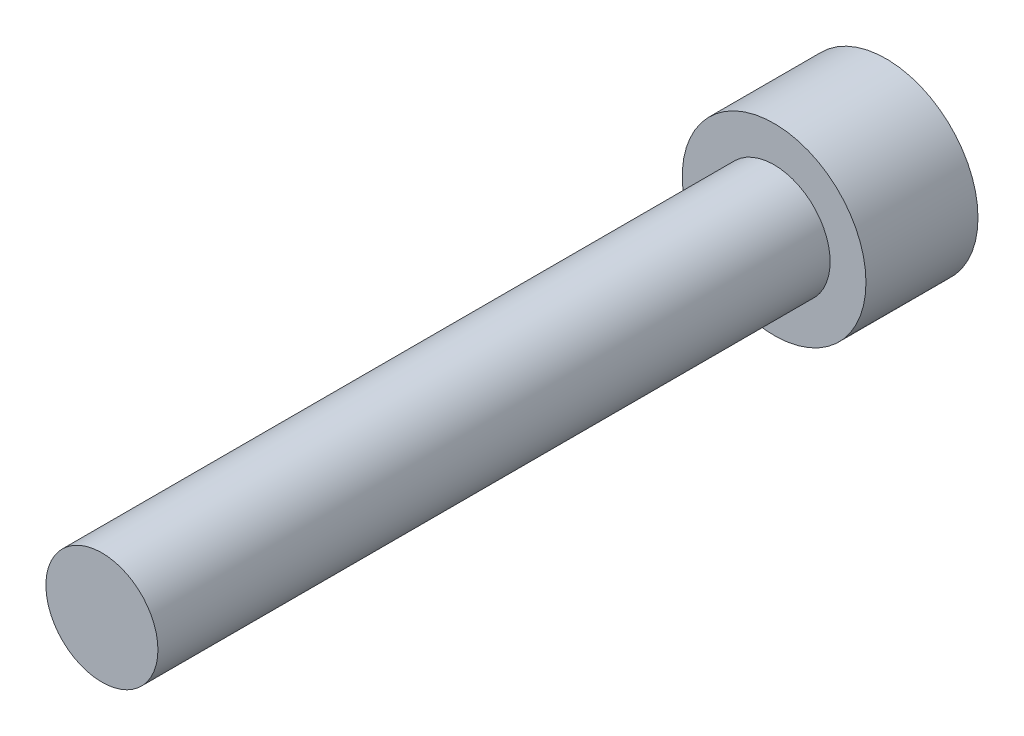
from build123d import *

# Parameters (mm, degrees)
HEX_2_DEPTH = 1.778


with BuildPart() as part:
    # Sketch6 → Revolve1 (revolve)
    with BuildSketch(Plane(origin=(0, 0, 0), x_dir=(0, 0, -1), z_dir=(1, 0, 0)), mode=Mode.PRIVATE) as revolve1_sk:
        Polygon((-19.05, 0), (-19.05, -1.5875), (0, -1.5875), (0, -2.6035), (3.175, -2.6035), (3.175, 0), align=None)
    revolve(revolve1_sk.sketch.rotate(Axis((0, 0, 19.05), (0, 0, -1)), 270), axis=Axis((0, 0, 19.05), (0, 0, -1)))

    # Sketch7 → HEX 2 (cut)
    with BuildSketch(Plane(origin=(0, 0, -3.175), x_dir=(-1, 0, 0), z_dir=(0, 0, -1))):
        Polygon((-1.1811, 0.681908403), (-1.1811, -0.681908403), (0, -1.363816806), (1.1811, -0.681908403), (1.1811, 0.681908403), (0, 1.363816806), align=None)
    extrude(amount=-HEX_2_DEPTH, mode=Mode.SUBTRACT)


solid = part.part
